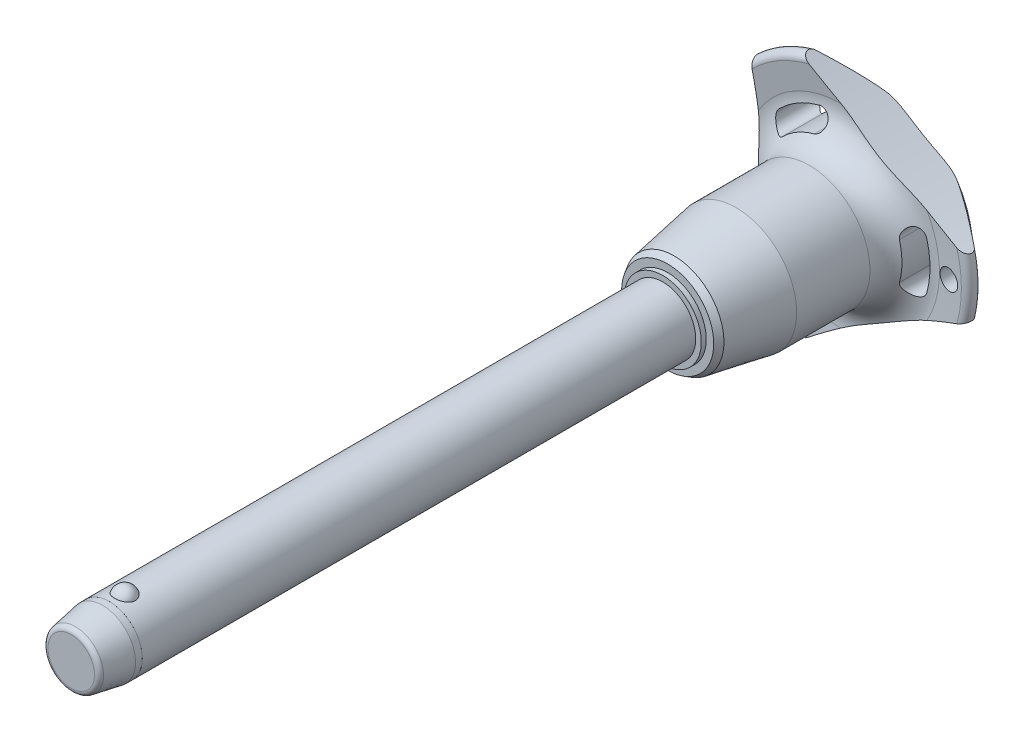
from build123d import *

# Parameters (mm, degrees)
SKETCH1_R           = 5
BOSS_EXTRUDE1_DEPTH = 80
SKETCH2_R           = 4.25
BOSS_EXTRUDE2_DEPTH = 33.3
BOSS_EXTRUDE3_START = 9.6
SKETCH1_2_R         = 5
BOSS_EXTRUDE3_DEPTH = 9.6
CHAMFER1_SIZE       = 4.8
CHAMFER1_SIZE2      = 0.846369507
FILLET1_R           = 0.75
SKETCH6_R           = 102.8
CUT_EXTRUDE1_DEPTH  = 117.644873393
CIRPATTERN1_COUNT   = 3
SKETCH7_R           = 1.5
CUT_EXTRUDE2_DEPTH  = 117.506132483
SKETCH8_R           = 5
SKETCH8_R_2         = 4.99
CUT_EXTRUDE3_DEPTH  = 5.76


with BuildPart() as part:
    # Sketch1 → Boss-Extrude1 (new body)
    with BuildSketch(Plane.XY):
        Circle(SKETCH1_R)
    extrude(amount=-BOSS_EXTRUDE1_DEPTH)

    # Sketch2 → Boss-Extrude2 (add)
    with BuildSketch(Plane(origin=(0, 0, -80), x_dir=(-1, 0, 0), z_dir=(0, 0, -1))):
        Circle(SKETCH2_R)
    extrude(amount=BOSS_EXTRUDE2_DEPTH)

    # Sketch3 → Revolve1 (revolve)
    with BuildSketch(Plane(origin=(0, 0, 0), x_dir=(0, 0, -1), z_dir=(1, 0, 0))):
        with BuildLine():
            Line((-1.516575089, 6), (-1.516575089, 2.7))
            ThreePointArc((-1.516575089, 2.7), (0.133424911, 4.35), (-1.516575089, 6))
        make_face()
        with BuildLine():
            Line((-1.516575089, -2.7), (-1.516575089, -6))
            ThreePointArc((-1.516575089, -6), (0.133424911, -4.35), (-1.516575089, -2.7))
        make_face()
    revolve(axis=Axis((0, -2.7, 1.516575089), (0, 1, 0)))

    # Sketch1_2 → Boss-Extrude3 (add)
    with BuildSketch(Plane.XY.offset(BOSS_EXTRUDE3_START)):
        Circle(SKETCH1_2_R)
    extrude(amount=-BOSS_EXTRUDE3_DEPTH)

    # Chamfer1
    chamfer1_edges = [part.edges().sort_by_distance(p)[0] for p in [
        (-5, 0, 9.6),
    ]]
    chamfer1_side = [part.faces().sort_by_distance(p)[0] for p in [
        (-5, 0, -35.2),
    ]]
    chamfer(chamfer1_edges, length=CHAMFER1_SIZE, length2=CHAMFER1_SIZE2, reference=chamfer1_side[0])

    # Fillet1
    fillet1_edges = [part.edges().sort_by_distance(p)[0] for p in [
        (-4.153630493, 0, 9.6),
        (4.25, 0, -113.3),
    ]]
    fillet(fillet1_edges, radius=FILLET1_R)

    # Sketch4 → Revolve2 (revolve)
    with BuildSketch(Plane(origin=(0, 0, 0), x_dir=(0, 0, -1), z_dir=(1, 0, 0)), mode=Mode.PRIVATE) as revolve2_sk:
        Polygon((80, 0), (80, 5.848880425), (80.75, 5.848880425), (80.75, 6.981619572), (81.730980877, 7.547989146), (91.1, 9.2), (102.2, 9.2), (102.2, 0), align=None)
    revolve(revolve2_sk.sketch.rotate(Axis((0, 0, -102.2), (0, 0, 1)), 90), axis=Axis((0, 0, -102.2), (0, 0, 1)))

    # Sketch5 → Revolve3 (revolve)
    with BuildSketch(Plane(origin=(0, 0, 0), x_dir=(0, 0, -1), z_dir=(1, 0, 0)), mode=Mode.PRIVATE) as revolve3_sk:
        with BuildLine():
            Line((107.169704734, 14.749576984), (106.756059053, 18.490084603))
            ThreePointArc((106.756059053, 18.490084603), (107.35677658, 19.519442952), (108.516044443, 19.24278761))
            Line((108.516044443, 19.24278761), (112.835691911, 14.094832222))
            ThreePointArc((112.835691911, 14.094832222), (113.3, 12.689260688), (112.67067517, 11.349423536))
            ThreePointArc((112.67067517, 11.349423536), (109.033110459, 6.185112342), (107.75, 0))
            Line((107.75, 0), (102.2, 0))
            Line((102.2, 0), (102.2, 9.2))
            ThreePointArc((102.2, 9.2), (105.924774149, 10.864425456), (107.169704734, 14.749576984))
        make_face()
    revolve(revolve3_sk.sketch.rotate(Axis((0, 0, -107.75), (0, 0, 1)), 90), axis=Axis((0, 0, -107.75), (0, 0, 1)))

    # Sketch6 → Cut-Extrude1 (cut, through all)
    with BuildSketch(Plane.XY):
        with Locations((-115.2, 0)):
            Circle(SKETCH6_R)
        with BuildLine():
            ThreePointArc((12.885043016, -3.538869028), (13.362182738, 0), (12.885043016, 3.538869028))
            ThreePointArc((12.885043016, 3.538869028), (11.179749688, 4.509281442), (10.209337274, 2.803988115))
            ThreePointArc((10.209337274, 2.803988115), (10.587394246, 0), (10.209337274, -2.803988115))
            ThreePointArc((10.209337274, -2.803988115), (11.179749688, -4.509281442), (12.885043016, -3.538869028))
        make_face()
    cut_extrude1 = extrude(amount=-CUT_EXTRUDE1_DEPTH, mode=Mode.SUBTRACT)

    # CirPattern1: Cut-Extrude1 ×3 about axis
    cirpattern1_axis = Axis((0, 0, 0), (0, 0, 1))
    for i in range(1, CIRPATTERN1_COUNT):
        add(cut_extrude1.rotate(cirpattern1_axis, i * 360 / CIRPATTERN1_COUNT), mode=Mode.SUBTRACT)

    # Sketch7 → Cut-Extrude2 (cut, through all)
    with BuildSketch(Plane.XY):
        with Locations(Location((16.362182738, 0, 0), (0, 0, 225.449470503))):
            Circle(SKETCH7_R)
    extrude(amount=-CUT_EXTRUDE2_DEPTH, mode=Mode.SUBTRACT)

    # Sketch8 → Cut-Extrude3 (cut)
    with BuildSketch(Plane.XY.offset(9.6)):
        Circle(SKETCH8_R)
        Circle(SKETCH8_R_2, mode=Mode.SUBTRACT)
    extrude(amount=-CUT_EXTRUDE3_DEPTH, mode=Mode.SUBTRACT)


solid = part.part
